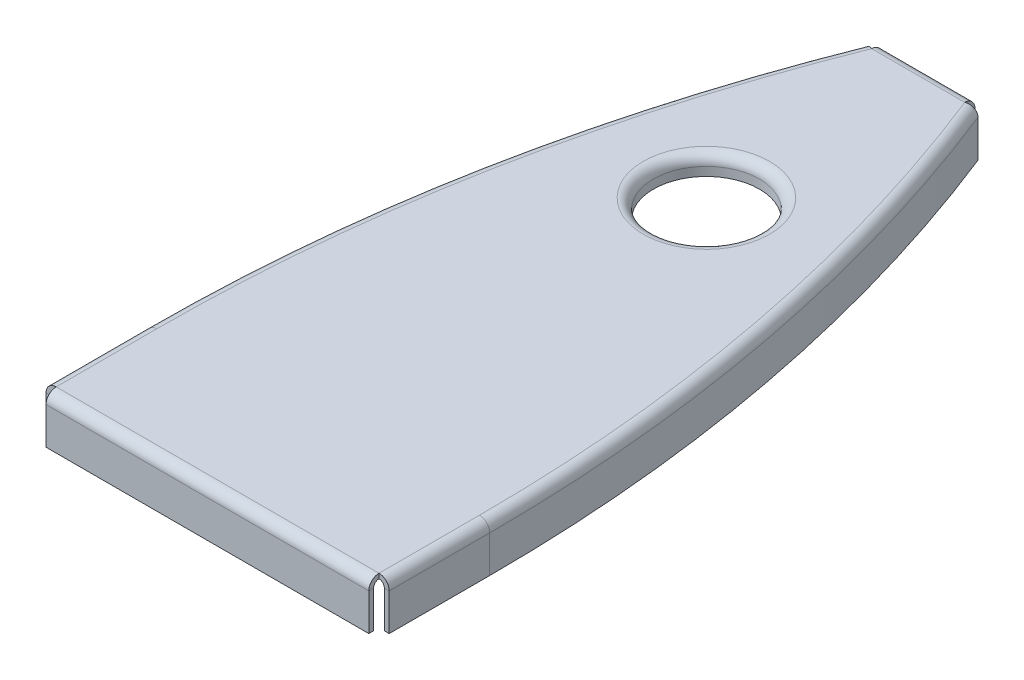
ISO-10303-21;
HEADER;
FILE_DESCRIPTION(('STEP AP214'),'2;1');
FILE_NAME('part.step','',(''),(''),'','','');
FILE_SCHEMA(('AUTOMOTIVE_DESIGN { 1 0 10303 214 1 1 1 1 }'));
ENDSEC;
DATA;
#1=APPLICATION_CONTEXT('core data for automotive mechanical design processes');
#2=APPLICATION_PROTOCOL_DEFINITION('international standard','automotive_design',2000,#1);
#3=PRODUCT_CONTEXT('',#1,'mechanical');
#4=PRODUCT('Part','Part','',(#3));
#5=PRODUCT_RELATED_PRODUCT_CATEGORY('part','',(#4));
#6=PRODUCT_DEFINITION_FORMATION('','',#4);
#7=PRODUCT_DEFINITION_CONTEXT('part definition',#1,'design');
#8=PRODUCT_DEFINITION('design','',#6,#7);
#9=PRODUCT_DEFINITION_SHAPE('','',#8);
#10=(LENGTH_UNIT() NAMED_UNIT(*) SI_UNIT(.MILLI.,.METRE.));
#11=(NAMED_UNIT(*) PLANE_ANGLE_UNIT() SI_UNIT($,.RADIAN.));
#12=(NAMED_UNIT(*) SI_UNIT($,.STERADIAN.) SOLID_ANGLE_UNIT());
#13=UNCERTAINTY_MEASURE_WITH_UNIT(LENGTH_MEASURE(1.E-05),#10,'distance_accuracy_value','');
#14=(GEOMETRIC_REPRESENTATION_CONTEXT(3) GLOBAL_UNCERTAINTY_ASSIGNED_CONTEXT((#13)) GLOBAL_UNIT_ASSIGNED_CONTEXT((#10,
#11,#12)) REPRESENTATION_CONTEXT('',''));
#15=CARTESIAN_POINT('',(0.,0.,0.));
#16=DIRECTION('',(0.,0.,1.));
#17=DIRECTION('',(1.,0.,0.));
#18=AXIS2_PLACEMENT_3D('',#15,#16,#17);
#19=CARTESIAN_POINT('',(114.3,0.,0.));
#20=DIRECTION('',(0.,-1.,0.));
#21=DIRECTION('',(0.,0.,-1.));
#22=AXIS2_PLACEMENT_3D('',#19,#20,#21);
#23=PLANE('',#22);
#24=CARTESIAN_POINT('',(0.,0.,-350.));
#25=DIRECTION('',(0.,-1.,0.));
#26=DIRECTION('',(0.,0.,-1.));
#27=AXIS2_PLACEMENT_3D('',#24,#25,#26);
#28=CIRCLE('',#27,44.7262999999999);
#29=CARTESIAN_POINT('',(0.,-8.15753714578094E-13,-394.7263));
#30=VERTEX_POINT('',#29);
#31=EDGE_CURVE('E13',#30,#30,#28,.T.);
#32=ORIENTED_EDGE('',*,*,#31,.F.);
#33=EDGE_LOOP('',(#32));
#34=FACE_BOUND('',#33,.T.);
#35=DIRECTION('',(0.,0.,1.));
#36=VECTOR('',#35,1.);
#37=CARTESIAN_POINT('',(-114.3,0.,0.));
#38=LINE('',#37,#36);
#39=CARTESIAN_POINT('',(-114.3,-8.15753714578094E-13,-75.));
#40=VERTEX_POINT('',#39);
#41=CARTESIAN_POINT('',(-114.3,0.,-3.80999999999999));
#42=VERTEX_POINT('',#41);
#43=EDGE_CURVE('E369',#40,#42,#38,.T.);
#44=ORIENTED_EDGE('',*,*,#43,.F.);
#45=CARTESIAN_POINT('',(1036.46329833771,-8.15753714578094E-13,-75.));
#46=DIRECTION('',(0.,1.,0.));
#47=DIRECTION('',(0.,0.,1.));
#48=AXIS2_PLACEMENT_3D('',#45,#46,#47);
#49=CIRCLE('',#48,1150.76329833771);
#50=CARTESIAN_POINT('',(-32.9436255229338,-8.15753714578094E-13,-500.));
#51=VERTEX_POINT('',#50);
#52=EDGE_CURVE('E551',#51,#40,#49,.T.);
#53=ORIENTED_EDGE('',*,*,#52,.F.);
#54=DIRECTION('',(-1.,0.,0.));
#55=VECTOR('',#54,1.);
#56=CARTESIAN_POINT('',(114.3,0.,-500.));
#57=LINE('',#56,#55);
#58=CARTESIAN_POINT('',(32.9436255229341,-8.03610650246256E-13,-500.));
#59=VERTEX_POINT('',#58);
#60=EDGE_CURVE('E385',#59,#51,#57,.T.);
#61=ORIENTED_EDGE('',*,*,#60,.F.);
#62=CARTESIAN_POINT('',(-1036.46329833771,-8.15753714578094E-13,-75.));
#63=DIRECTION('',(0.,1.,0.));
#64=DIRECTION('',(0.,0.,1.));
#65=AXIS2_PLACEMENT_3D('',#62,#63,#64);
#66=CIRCLE('',#65,1150.76329833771);
#67=CARTESIAN_POINT('',(114.3,-8.03610650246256E-13,-74.9999999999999));
#68=VERTEX_POINT('',#67);
#69=EDGE_CURVE('E417',#59,#68,#66,.F.);
#70=ORIENTED_EDGE('',*,*,#69,.T.);
#71=DIRECTION('',(0.,0.,1.));
#72=VECTOR('',#71,1.);
#73=CARTESIAN_POINT('',(114.3,0.,0.));
#74=LINE('',#73,#72);
#75=CARTESIAN_POINT('',(114.3,0.,-3.81));
#76=VERTEX_POINT('',#75);
#77=EDGE_CURVE('E348',#68,#76,#74,.T.);
#78=ORIENTED_EDGE('',*,*,#77,.T.);
#79=DIRECTION('',(-1.,0.,0.));
#80=VECTOR('',#79,1.);
#81=CARTESIAN_POINT('',(114.3,0.,-3.81));
#82=LINE('',#81,#80);
#83=EDGE_CURVE('E339',#76,#42,#82,.T.);
#84=ORIENTED_EDGE('',*,*,#83,.T.);
#85=EDGE_LOOP('',(#44,#53,#61,#70,#78,#84));
#86=FACE_BOUND('',#85,.T.);
#87=ADVANCED_FACE('F257',(#34,#86),#23,.T.);
#88=CARTESIAN_POINT('',(114.3,3.4163,0.));
#89=DIRECTION('',(0.,-1.,0.));
#90=DIRECTION('',(0.,0.,-1.));
#91=AXIS2_PLACEMENT_3D('',#88,#89,#90);
#92=PLANE('',#91);
#93=CARTESIAN_POINT('',(0.,3.41629999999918,-350.));
#94=DIRECTION('',(0.,-1.,0.));
#95=DIRECTION('',(0.,0.,-1.));
#96=AXIS2_PLACEMENT_3D('',#93,#94,#95);
#97=CIRCLE('',#96,44.7262999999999);
#98=CARTESIAN_POINT('',(0.,3.4163,-394.7263));
#99=VERTEX_POINT('',#98);
#100=EDGE_CURVE('E1433',#99,#99,#97,.T.);
#101=ORIENTED_EDGE('',*,*,#100,.T.);
#102=EDGE_LOOP('',(#101));
#103=FACE_BOUND('',#102,.T.);
#104=CARTESIAN_POINT('',(1036.46329833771,3.41629999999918,-75.));
#105=DIRECTION('',(0.,1.,0.));
#106=DIRECTION('',(0.,0.,1.));
#107=AXIS2_PLACEMENT_3D('',#104,#105,#106);
#108=CIRCLE('',#107,1150.76329833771);
#109=CARTESIAN_POINT('',(-32.9436255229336,3.41629999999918,-500.));
#110=VERTEX_POINT('',#109);
#111=CARTESIAN_POINT('',(-114.3,3.41629999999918,-75.0000000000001));
#112=VERTEX_POINT('',#111);
#113=EDGE_CURVE('E554',#110,#112,#108,.T.);
#114=ORIENTED_EDGE('',*,*,#113,.T.);
#115=DIRECTION('',(0.,0.,-1.));
#116=VECTOR('',#115,1.);
#117=CARTESIAN_POINT('',(-114.3,3.4163,0.));
#118=LINE('',#117,#116);
#119=CARTESIAN_POINT('',(-114.3,3.4163,-3.81));
#120=VERTEX_POINT('',#119);
#121=EDGE_CURVE('E372',#112,#120,#118,.F.);
#122=ORIENTED_EDGE('',*,*,#121,.T.);
#123=DIRECTION('',(-1.,0.,0.));
#124=VECTOR('',#123,1.);
#125=CARTESIAN_POINT('',(114.3,3.4163,-3.81));
#126=LINE('',#125,#124);
#127=CARTESIAN_POINT('',(114.3,3.41630000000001,-3.80999999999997));
#128=VERTEX_POINT('',#127);
#129=EDGE_CURVE('E379',#128,#120,#126,.T.);
#130=ORIENTED_EDGE('',*,*,#129,.F.);
#131=DIRECTION('',(0.,0.,-1.));
#132=VECTOR('',#131,1.);
#133=CARTESIAN_POINT('',(114.3,3.4163,0.));
#134=LINE('',#133,#132);
#135=CARTESIAN_POINT('',(114.3,3.4162999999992,-74.9999999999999));
#136=VERTEX_POINT('',#135);
#137=EDGE_CURVE('E351',#136,#128,#134,.F.);
#138=ORIENTED_EDGE('',*,*,#137,.F.);
#139=CARTESIAN_POINT('',(-1036.46329833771,3.41629999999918,-75.));
#140=DIRECTION('',(0.,1.,0.));
#141=DIRECTION('',(0.,0.,1.));
#142=AXIS2_PLACEMENT_3D('',#139,#140,#141);
#143=CIRCLE('',#142,1150.76329833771);
#144=CARTESIAN_POINT('',(32.9436255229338,3.4162999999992,-500.));
#145=VERTEX_POINT('',#144);
#146=EDGE_CURVE('E542',#145,#136,#143,.F.);
#147=ORIENTED_EDGE('',*,*,#146,.F.);
#148=DIRECTION('',(-1.,0.,0.));
#149=VECTOR('',#148,1.);
#150=CARTESIAN_POINT('',(114.3,3.4163,-500.));
#151=LINE('',#150,#149);
#152=EDGE_CURVE('E382',#145,#110,#151,.T.);
#153=ORIENTED_EDGE('',*,*,#152,.T.);
#154=EDGE_LOOP('',(#114,#122,#130,#138,#147,#153));
#155=FACE_BOUND('',#154,.T.);
#156=ADVANCED_FACE('F592',(#103,#155),#92,.F.);
#157=CARTESIAN_POINT('',(114.3,-3.81,0.));
#158=DIRECTION('',(1.,0.,0.));
#159=DIRECTION('',(0.,0.,-1.));
#160=AXIS2_PLACEMENT_3D('',#157,#158,#159);
#161=PLANE('',#160);
#162=DIRECTION('',(0.,0.,1.));
#163=VECTOR('',#162,1.);
#164=CARTESIAN_POINT('',(114.3,-3.81,0.));
#165=LINE('',#164,#163);
#166=CARTESIAN_POINT('',(114.3,-3.81,0.));
#167=VERTEX_POINT('',#166);
#168=CARTESIAN_POINT('',(114.3,-3.81,3.4163));
#169=VERTEX_POINT('',#168);
#170=EDGE_CURVE('E265',#167,#169,#165,.T.);
#171=ORIENTED_EDGE('',*,*,#170,.F.);
#172=CARTESIAN_POINT('',(114.3,-3.81,-3.81));
#173=DIRECTION('',(-1.,0.,0.));
#174=DIRECTION('',(0.,0.,1.));
#175=AXIS2_PLACEMENT_3D('',#172,#173,#174);
#176=CIRCLE('',#175,3.81);
#177=EDGE_CURVE('E322',#76,#167,#176,.F.);
#178=ORIENTED_EDGE('',*,*,#177,.F.);
#179=DIRECTION('',(0.,-1.,0.));
#180=VECTOR('',#179,1.);
#181=CARTESIAN_POINT('',(114.3,3.4163,-3.81));
#182=LINE('',#181,#180);
#183=EDGE_CURVE('E326',#128,#76,#182,.T.);
#184=ORIENTED_EDGE('',*,*,#183,.F.);
#185=CARTESIAN_POINT('',(114.3,-3.81,-3.81));
#186=DIRECTION('',(1.,0.,0.));
#187=DIRECTION('',(0.,0.,-1.));
#188=AXIS2_PLACEMENT_3D('',#185,#186,#187);
#189=CIRCLE('',#188,7.2263);
#190=EDGE_CURVE('E324',#128,#169,#189,.T.);
#191=ORIENTED_EDGE('',*,*,#190,.T.);
#192=EDGE_LOOP('',(#171,#178,#184,#191));
#193=FACE_BOUND('',#192,.T.);
#194=ADVANCED_FACE('F259',(#193),#161,.T.);
#195=CARTESIAN_POINT('',(114.3,3.4163,-3.81));
#196=DIRECTION('',(1.,0.,0.));
#197=DIRECTION('',(0.,0.,-1.));
#198=AXIS2_PLACEMENT_3D('',#195,#196,#197);
#199=PLANE('',#198);
#200=DIRECTION('',(0.,-1.,0.));
#201=VECTOR('',#200,1.);
#202=CARTESIAN_POINT('',(114.3,0.,0.));
#203=LINE('',#202,#201);
#204=CARTESIAN_POINT('',(114.3,-30.,0.));
#205=VERTEX_POINT('',#204);
#206=EDGE_CURVE('E333',#167,#205,#203,.T.);
#207=ORIENTED_EDGE('',*,*,#206,.F.);
#208=ORIENTED_EDGE('',*,*,#170,.T.);
#209=DIRECTION('',(0.,-1.,0.));
#210=VECTOR('',#209,1.);
#211=CARTESIAN_POINT('',(114.3,0.,3.4163));
#212=LINE('',#211,#210);
#213=CARTESIAN_POINT('',(114.3,-30.,3.4163));
#214=VERTEX_POINT('',#213);
#215=EDGE_CURVE('E310',#169,#214,#212,.T.);
#216=ORIENTED_EDGE('',*,*,#215,.T.);
#217=DIRECTION('',(0.,0.,1.));
#218=VECTOR('',#217,1.);
#219=CARTESIAN_POINT('',(114.3,-30.,0.));
#220=LINE('',#219,#218);
#221=EDGE_CURVE('E343',#205,#214,#220,.T.);
#222=ORIENTED_EDGE('',*,*,#221,.F.);
#223=EDGE_LOOP('',(#207,#208,#216,#222));
#224=FACE_BOUND('',#223,.T.);
#225=ADVANCED_FACE('F341',(#224),#199,.T.);
#226=CARTESIAN_POINT('',(-114.3,0.,-3.81));
#227=DIRECTION('',(-1.,0.,0.));
#228=DIRECTION('',(0.,0.,1.));
#229=AXIS2_PLACEMENT_3D('',#226,#227,#228);
#230=PLANE('',#229);
#231=DIRECTION('',(0.,1.,0.));
#232=VECTOR('',#231,1.);
#233=CARTESIAN_POINT('',(-114.3,0.,-3.81));
#234=LINE('',#233,#232);
#235=EDGE_CURVE('E393',#42,#120,#234,.T.);
#236=ORIENTED_EDGE('',*,*,#235,.F.);
#237=CARTESIAN_POINT('',(-114.3,-3.81,-3.81));
#238=DIRECTION('',(-1.,0.,0.));
#239=DIRECTION('',(0.,0.,1.));
#240=AXIS2_PLACEMENT_3D('',#237,#238,#239);
#241=CIRCLE('',#240,3.81);
#242=CARTESIAN_POINT('',(-114.3,-3.81,0.));
#243=VERTEX_POINT('',#242);
#244=EDGE_CURVE('E367',#42,#243,#241,.F.);
#245=ORIENTED_EDGE('',*,*,#244,.T.);
#246=DIRECTION('',(0.,0.,-1.));
#247=VECTOR('',#246,1.);
#248=CARTESIAN_POINT('',(-114.3,-3.81,3.4163));
#249=LINE('',#248,#247);
#250=CARTESIAN_POINT('',(-114.3,-3.81,3.4163));
#251=VERTEX_POINT('',#250);
#252=EDGE_CURVE('E304',#251,#243,#249,.T.);
#253=ORIENTED_EDGE('',*,*,#252,.F.);
#254=CARTESIAN_POINT('',(-114.3,-3.81,-3.81));
#255=DIRECTION('',(1.,0.,0.));
#256=DIRECTION('',(0.,0.,-1.));
#257=AXIS2_PLACEMENT_3D('',#254,#255,#256);
#258=CIRCLE('',#257,7.2263);
#259=EDGE_CURVE('E375',#120,#251,#258,.T.);
#260=ORIENTED_EDGE('',*,*,#259,.F.);
#261=EDGE_LOOP('',(#236,#245,#253,#260));
#262=FACE_BOUND('',#261,.T.);
#263=ADVANCED_FACE('F576',(#262),#230,.T.);
#264=CARTESIAN_POINT('',(114.3,0.,3.4163));
#265=DIRECTION('',(0.,0.,-1.));
#266=DIRECTION('',(0.,1.,0.));
#267=AXIS2_PLACEMENT_3D('',#264,#265,#266);
#268=PLANE('',#267);
#269=DIRECTION('',(0.,-1.,0.));
#270=VECTOR('',#269,1.);
#271=CARTESIAN_POINT('',(-114.3,0.,3.4163));
#272=LINE('',#271,#270);
#273=CARTESIAN_POINT('',(-114.3,-30.,3.4163));
#274=VERTEX_POINT('',#273);
#275=EDGE_CURVE('E359',#251,#274,#272,.T.);
#276=ORIENTED_EDGE('',*,*,#275,.T.);
#277=DIRECTION('',(-1.,0.,0.));
#278=VECTOR('',#277,1.);
#279=CARTESIAN_POINT('',(114.3,-30.,3.4163));
#280=LINE('',#279,#278);
#281=EDGE_CURVE('E390',#214,#274,#280,.T.);
#282=ORIENTED_EDGE('',*,*,#281,.F.);
#283=ORIENTED_EDGE('',*,*,#215,.F.);
#284=DIRECTION('',(-1.,0.,0.));
#285=VECTOR('',#284,1.);
#286=CARTESIAN_POINT('',(114.3,-3.81,3.4163));
#287=LINE('',#286,#285);
#288=EDGE_CURVE('E358',#169,#251,#287,.T.);
#289=ORIENTED_EDGE('',*,*,#288,.T.);
#290=EDGE_LOOP('',(#276,#282,#283,#289));
#291=FACE_BOUND('',#290,.T.);
#292=ADVANCED_FACE('F572',(#291),#268,.F.);
#293=CARTESIAN_POINT('',(114.3,-30.,0.));
#294=DIRECTION('',(0.,-1.,0.));
#295=DIRECTION('',(0.,0.,-1.));
#296=AXIS2_PLACEMENT_3D('',#293,#294,#295);
#297=PLANE('',#296);
#298=DIRECTION('',(0.,0.,1.));
#299=VECTOR('',#298,1.);
#300=CARTESIAN_POINT('',(-114.3,-30.,0.));
#301=LINE('',#300,#299);
#302=CARTESIAN_POINT('',(-114.3,-30.,0.));
#303=VERTEX_POINT('',#302);
#304=EDGE_CURVE('E362',#303,#274,#301,.T.);
#305=ORIENTED_EDGE('',*,*,#304,.F.);
#306=DIRECTION('',(-1.,0.,0.));
#307=VECTOR('',#306,1.);
#308=CARTESIAN_POINT('',(114.3,-30.,0.));
#309=LINE('',#308,#307);
#310=EDGE_CURVE('E338',#205,#303,#309,.T.);
#311=ORIENTED_EDGE('',*,*,#310,.F.);
#312=ORIENTED_EDGE('',*,*,#221,.T.);
#313=ORIENTED_EDGE('',*,*,#281,.T.);
#314=EDGE_LOOP('',(#305,#311,#312,#313));
#315=FACE_BOUND('',#314,.T.);
#316=ADVANCED_FACE('F567',(#315),#297,.T.);
#317=CARTESIAN_POINT('',(114.3,0.,0.));
#318=DIRECTION('',(0.,0.,-1.));
#319=DIRECTION('',(0.,1.,0.));
#320=AXIS2_PLACEMENT_3D('',#317,#318,#319);
#321=PLANE('',#320);
#322=DIRECTION('',(0.,-1.,0.));
#323=VECTOR('',#322,1.);
#324=CARTESIAN_POINT('',(-114.3,0.,0.));
#325=LINE('',#324,#323);
#326=EDGE_CURVE('E335',#243,#303,#325,.T.);
#327=ORIENTED_EDGE('',*,*,#326,.F.);
#328=DIRECTION('',(-1.,0.,0.));
#329=VECTOR('',#328,1.);
#330=CARTESIAN_POINT('',(114.3,-3.81,0.));
#331=LINE('',#330,#329);
#332=EDGE_CURVE('E331',#167,#243,#331,.T.);
#333=ORIENTED_EDGE('',*,*,#332,.F.);
#334=ORIENTED_EDGE('',*,*,#206,.T.);
#335=ORIENTED_EDGE('',*,*,#310,.T.);
#336=EDGE_LOOP('',(#327,#333,#334,#335));
#337=FACE_BOUND('',#336,.T.);
#338=ADVANCED_FACE('F332',(#337),#321,.T.);
#339=CARTESIAN_POINT('',(114.3,-3.81,-3.81));
#340=DIRECTION('',(-1.,0.,0.));
#341=DIRECTION('',(0.,0.,1.));
#342=AXIS2_PLACEMENT_3D('',#339,#340,#341);
#343=CYLINDRICAL_SURFACE('',#342,3.81);
#344=ORIENTED_EDGE('',*,*,#244,.F.);
#345=ORIENTED_EDGE('',*,*,#83,.F.);
#346=ORIENTED_EDGE('',*,*,#177,.T.);
#347=ORIENTED_EDGE('',*,*,#332,.T.);
#348=EDGE_LOOP('',(#344,#345,#346,#347));
#349=FACE_BOUND('',#348,.T.);
#350=ADVANCED_FACE('F346',(#349),#343,.F.);
#351=CARTESIAN_POINT('',(114.3,-3.81,-3.81));
#352=DIRECTION('',(-1.,0.,0.));
#353=DIRECTION('',(0.,0.,1.));
#354=AXIS2_PLACEMENT_3D('',#351,#352,#353);
#355=CYLINDRICAL_SURFACE('',#354,7.2263);
#356=ORIENTED_EDGE('',*,*,#259,.T.);
#357=ORIENTED_EDGE('',*,*,#288,.F.);
#358=ORIENTED_EDGE('',*,*,#190,.F.);
#359=ORIENTED_EDGE('',*,*,#129,.T.);
#360=EDGE_LOOP('',(#356,#357,#358,#359));
#361=FACE_BOUND('',#360,.T.);
#362=ADVANCED_FACE('F574',(#361),#355,.T.);
#363=CARTESIAN_POINT('',(-114.3,-3.81,-3.81));
#364=DIRECTION('',(-1.,0.,0.));
#365=DIRECTION('',(0.,0.,1.));
#366=AXIS2_PLACEMENT_3D('',#363,#364,#365);
#367=PLANE('',#366);
#368=ORIENTED_EDGE('',*,*,#275,.F.);
#369=ORIENTED_EDGE('',*,*,#252,.T.);
#370=ORIENTED_EDGE('',*,*,#326,.T.);
#371=ORIENTED_EDGE('',*,*,#304,.T.);
#372=EDGE_LOOP('',(#368,#369,#370,#371));
#373=FACE_BOUND('',#372,.T.);
#374=ADVANCED_FACE('F570',(#373),#367,.T.);
#375=CARTESIAN_POINT('',(-32.9436255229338,-3.81000000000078,-500.));
#376=DIRECTION('',(-1.,0.,0.));
#377=DIRECTION('',(0.,0.,1.));
#378=AXIS2_PLACEMENT_3D('',#375,#376,#377);
#379=PLANE('',#378);
#380=DIRECTION('',(0.,0.,-1.));
#381=VECTOR('',#380,1.);
#382=CARTESIAN_POINT('',(-32.9436255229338,-3.81000000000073,-507.2263));
#383=LINE('',#382,#381);
#384=CARTESIAN_POINT('',(-32.9436255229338,-3.81000000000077,-503.81));
#385=VERTEX_POINT('',#384);
#386=CARTESIAN_POINT('',(-32.9436255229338,-3.81000000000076,-507.2263));
#387=VERTEX_POINT('',#386);
#388=EDGE_CURVE('E500',#385,#387,#383,.T.);
#389=ORIENTED_EDGE('',*,*,#388,.F.);
#390=CARTESIAN_POINT('',(-32.9436255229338,-3.81000000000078,-500.));
#391=DIRECTION('',(1.,0.,0.));
#392=DIRECTION('',(0.,0.,-1.));
#393=AXIS2_PLACEMENT_3D('',#390,#391,#392);
#394=CIRCLE('',#393,3.80999999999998);
#395=EDGE_CURVE('E546',#51,#385,#394,.F.);
#396=ORIENTED_EDGE('',*,*,#395,.F.);
#397=DIRECTION('',(0.,1.,0.));
#398=VECTOR('',#397,1.);
#399=CARTESIAN_POINT('',(-32.9436255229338,-8.15753714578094E-13,-500.));
#400=LINE('',#399,#398);
#401=EDGE_CURVE('E363',#51,#110,#400,.T.);
#402=ORIENTED_EDGE('',*,*,#401,.T.);
#403=CARTESIAN_POINT('',(-32.9436255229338,-3.81000000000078,-500.));
#404=DIRECTION('',(1.,0.,0.));
#405=DIRECTION('',(0.,0.,-1.));
#406=AXIS2_PLACEMENT_3D('',#403,#404,#405);
#407=CIRCLE('',#406,7.22629999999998);
#408=EDGE_CURVE('E539',#110,#387,#407,.F.);
#409=ORIENTED_EDGE('',*,*,#408,.T.);
#410=EDGE_LOOP('',(#389,#396,#402,#409));
#411=FACE_BOUND('',#410,.T.);
#412=ADVANCED_FACE('F800',(#411),#379,.T.);
#413=CARTESIAN_POINT('',(32.9436255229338,-3.81000000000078,-500.));
#414=DIRECTION('',(-1.,0.,0.));
#415=DIRECTION('',(0.,0.,1.));
#416=AXIS2_PLACEMENT_3D('',#413,#414,#415);
#417=PLANE('',#416);
#418=CARTESIAN_POINT('',(32.9436255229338,-3.81000000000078,-500.));
#419=DIRECTION('',(1.,0.,0.));
#420=DIRECTION('',(0.,0.,-1.));
#421=AXIS2_PLACEMENT_3D('',#418,#419,#420);
#422=CIRCLE('',#421,3.80999999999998);
#423=CARTESIAN_POINT('',(32.9436255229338,-3.81000000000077,-503.81));
#424=VERTEX_POINT('',#423);
#425=EDGE_CURVE('E506',#424,#59,#422,.T.);
#426=ORIENTED_EDGE('',*,*,#425,.F.);
#427=DIRECTION('',(0.,0.,-1.));
#428=VECTOR('',#427,1.);
#429=CARTESIAN_POINT('',(32.9436255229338,-3.81000000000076,-503.81));
#430=LINE('',#429,#428);
#431=CARTESIAN_POINT('',(32.9436255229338,-3.81000000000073,-507.2263));
#432=VERTEX_POINT('',#431);
#433=EDGE_CURVE('E531',#424,#432,#430,.T.);
#434=ORIENTED_EDGE('',*,*,#433,.T.);
#435=CARTESIAN_POINT('',(32.9436255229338,-3.81000000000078,-500.));
#436=DIRECTION('',(1.,0.,0.));
#437=DIRECTION('',(0.,0.,-1.));
#438=AXIS2_PLACEMENT_3D('',#435,#436,#437);
#439=CIRCLE('',#438,7.22629999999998);
#440=EDGE_CURVE('E543',#432,#145,#439,.T.);
#441=ORIENTED_EDGE('',*,*,#440,.T.);
#442=DIRECTION('',(0.,1.,0.));
#443=VECTOR('',#442,1.);
#444=CARTESIAN_POINT('',(32.9436255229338,-8.15753714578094E-13,-500.));
#445=LINE('',#444,#443);
#446=EDGE_CURVE('E557',#59,#145,#445,.T.);
#447=ORIENTED_EDGE('',*,*,#446,.F.);
#448=EDGE_LOOP('',(#426,#434,#441,#447));
#449=FACE_BOUND('',#448,.T.);
#450=ADVANCED_FACE('F784',(#449),#417,.F.);
#451=CARTESIAN_POINT('',(32.9436255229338,-3.81000000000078,-500.));
#452=DIRECTION('',(1.,0.,0.));
#453=DIRECTION('',(0.,0.,-1.));
#454=AXIS2_PLACEMENT_3D('',#451,#452,#453);
#455=CYLINDRICAL_SURFACE('',#454,7.22629999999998);
#456=ORIENTED_EDGE('',*,*,#152,.F.);
#457=ORIENTED_EDGE('',*,*,#440,.F.);
#458=DIRECTION('',(1.,0.,0.));
#459=VECTOR('',#458,1.);
#460=CARTESIAN_POINT('',(0.,-3.81000000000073,-507.2263));
#461=LINE('',#460,#459);
#462=EDGE_CURVE('E528',#387,#432,#461,.T.);
#463=ORIENTED_EDGE('',*,*,#462,.F.);
#464=ORIENTED_EDGE('',*,*,#408,.F.);
#465=EDGE_LOOP('',(#456,#457,#463,#464));
#466=FACE_BOUND('',#465,.T.);
#467=ADVANCED_FACE('F799',(#466),#455,.T.);
#468=CARTESIAN_POINT('',(32.9436255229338,-3.81000000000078,-500.));
#469=DIRECTION('',(1.,0.,0.));
#470=DIRECTION('',(0.,0.,-1.));
#471=AXIS2_PLACEMENT_3D('',#468,#469,#470);
#472=CYLINDRICAL_SURFACE('',#471,3.80999999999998);
#473=ORIENTED_EDGE('',*,*,#60,.T.);
#474=ORIENTED_EDGE('',*,*,#395,.T.);
#475=DIRECTION('',(-1.,0.,0.));
#476=VECTOR('',#475,1.);
#477=CARTESIAN_POINT('',(-32.9436255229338,-3.81000000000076,-503.81));
#478=LINE('',#477,#476);
#479=EDGE_CURVE('E534',#385,#424,#478,.F.);
#480=ORIENTED_EDGE('',*,*,#479,.T.);
#481=ORIENTED_EDGE('',*,*,#425,.T.);
#482=EDGE_LOOP('',(#473,#474,#480,#481));
#483=FACE_BOUND('',#482,.T.);
#484=ADVANCED_FACE('F779',(#483),#472,.F.);
#485=CARTESIAN_POINT('',(32.9436255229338,-8.03825766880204E-13,-507.2263));
#486=DIRECTION('',(1.,0.,0.));
#487=DIRECTION('',(0.,0.,-1.));
#488=AXIS2_PLACEMENT_3D('',#485,#486,#487);
#489=PLANE('',#488);
#490=DIRECTION('',(0.,1.,0.));
#491=VECTOR('',#490,1.);
#492=CARTESIAN_POINT('',(32.9436255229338,-8.03825766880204E-13,-507.2263));
#493=LINE('',#492,#491);
#494=CARTESIAN_POINT('',(32.9436255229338,-29.9999999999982,-507.2263));
#495=VERTEX_POINT('',#494);
#496=EDGE_CURVE('E510',#495,#432,#493,.T.);
#497=ORIENTED_EDGE('',*,*,#496,.T.);
#498=ORIENTED_EDGE('',*,*,#433,.F.);
#499=DIRECTION('',(0.,-1.,0.));
#500=VECTOR('',#499,1.);
#501=CARTESIAN_POINT('',(32.9436255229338,1.85037170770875E-12,-503.81));
#502=LINE('',#501,#500);
#503=CARTESIAN_POINT('',(32.9436255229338,-29.9999999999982,-503.81));
#504=VERTEX_POINT('',#503);
#505=EDGE_CURVE('E519',#504,#424,#502,.F.);
#506=ORIENTED_EDGE('',*,*,#505,.F.);
#507=DIRECTION('',(0.,0.,1.));
#508=VECTOR('',#507,1.);
#509=CARTESIAN_POINT('',(32.9436255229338,-29.9999999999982,-507.2263));
#510=LINE('',#509,#508);
#511=EDGE_CURVE('E503',#495,#504,#510,.T.);
#512=ORIENTED_EDGE('',*,*,#511,.F.);
#513=EDGE_LOOP('',(#497,#498,#506,#512));
#514=FACE_BOUND('',#513,.T.);
#515=ADVANCED_FACE('F790',(#514),#489,.T.);
#516=CARTESIAN_POINT('',(-32.9436255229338,-29.9999999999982,-507.2263));
#517=DIRECTION('',(-1.,0.,0.));
#518=DIRECTION('',(0.,0.,1.));
#519=AXIS2_PLACEMENT_3D('',#516,#517,#518);
#520=PLANE('',#519);
#521=DIRECTION('',(0.,1.,0.));
#522=VECTOR('',#521,1.);
#523=CARTESIAN_POINT('',(-32.9436255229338,1.85037170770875E-12,-503.81));
#524=LINE('',#523,#522);
#525=CARTESIAN_POINT('',(-32.9436255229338,-29.9999999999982,-503.81));
#526=VERTEX_POINT('',#525);
#527=EDGE_CURVE('E525',#385,#526,#524,.F.);
#528=ORIENTED_EDGE('',*,*,#527,.F.);
#529=ORIENTED_EDGE('',*,*,#388,.T.);
#530=DIRECTION('',(0.,-1.,0.));
#531=VECTOR('',#530,1.);
#532=CARTESIAN_POINT('',(-32.9436255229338,-29.9999999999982,-507.2263));
#533=LINE('',#532,#531);
#534=CARTESIAN_POINT('',(-32.9436255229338,-29.9999999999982,-507.2263));
#535=VERTEX_POINT('',#534);
#536=EDGE_CURVE('E516',#387,#535,#533,.T.);
#537=ORIENTED_EDGE('',*,*,#536,.T.);
#538=DIRECTION('',(0.,0.,1.));
#539=VECTOR('',#538,1.);
#540=CARTESIAN_POINT('',(-32.9436255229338,-29.9999999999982,-507.2263));
#541=LINE('',#540,#539);
#542=EDGE_CURVE('E507',#535,#526,#541,.T.);
#543=ORIENTED_EDGE('',*,*,#542,.T.);
#544=EDGE_LOOP('',(#528,#529,#537,#543));
#545=FACE_BOUND('',#544,.T.);
#546=ADVANCED_FACE('F802',(#545),#520,.T.);
#547=CARTESIAN_POINT('',(0.,1.86229965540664E-12,-507.2263));
#548=DIRECTION('',(0.,0.,-1.));
#549=DIRECTION('',(0.,1.,0.));
#550=AXIS2_PLACEMENT_3D('',#547,#548,#549);
#551=PLANE('',#550);
#552=ORIENTED_EDGE('',*,*,#536,.F.);
#553=ORIENTED_EDGE('',*,*,#462,.T.);
#554=ORIENTED_EDGE('',*,*,#496,.F.);
#555=DIRECTION('',(1.,0.,0.));
#556=VECTOR('',#555,1.);
#557=CARTESIAN_POINT('',(32.9436255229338,-29.9999999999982,-507.2263));
#558=LINE('',#557,#556);
#559=EDGE_CURVE('E513',#535,#495,#558,.T.);
#560=ORIENTED_EDGE('',*,*,#559,.F.);
#561=EDGE_LOOP('',(#552,#553,#554,#560));
#562=FACE_BOUND('',#561,.T.);
#563=ADVANCED_FACE('F795',(#562),#551,.T.);
#564=CARTESIAN_POINT('',(0.,1.85037170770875E-12,-503.81));
#565=DIRECTION('',(0.,0.,-1.));
#566=DIRECTION('',(0.,1.,0.));
#567=AXIS2_PLACEMENT_3D('',#564,#565,#566);
#568=PLANE('',#567);
#569=ORIENTED_EDGE('',*,*,#479,.F.);
#570=ORIENTED_EDGE('',*,*,#527,.T.);
#571=DIRECTION('',(-1.,0.,0.));
#572=VECTOR('',#571,1.);
#573=CARTESIAN_POINT('',(0.,-29.9999999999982,-503.81));
#574=LINE('',#573,#572);
#575=EDGE_CURVE('E522',#526,#504,#574,.F.);
#576=ORIENTED_EDGE('',*,*,#575,.T.);
#577=ORIENTED_EDGE('',*,*,#505,.T.);
#578=EDGE_LOOP('',(#569,#570,#576,#577));
#579=FACE_BOUND('',#578,.T.);
#580=ADVANCED_FACE('F787',(#579),#568,.F.);
#581=CARTESIAN_POINT('',(32.9436255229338,-29.9999999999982,-507.2263));
#582=DIRECTION('',(0.,-1.,0.));
#583=DIRECTION('',(0.,0.,-1.));
#584=AXIS2_PLACEMENT_3D('',#581,#582,#583);
#585=PLANE('',#584);
#586=ORIENTED_EDGE('',*,*,#575,.F.);
#587=ORIENTED_EDGE('',*,*,#542,.F.);
#588=ORIENTED_EDGE('',*,*,#559,.T.);
#589=ORIENTED_EDGE('',*,*,#511,.T.);
#590=EDGE_LOOP('',(#586,#587,#588,#589));
#591=FACE_BOUND('',#590,.T.);
#592=ADVANCED_FACE('F805',(#591),#585,.T.);
#593=CARTESIAN_POINT('',(114.3,-3.80999999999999,-3.80999999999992));
#594=DIRECTION('',(0.,0.,-1.));
#595=DIRECTION('',(0.,1.,0.));
#596=AXIS2_PLACEMENT_3D('',#593,#594,#595);
#597=PLANE('',#596);
#598=DIRECTION('',(-1.,0.,0.));
#599=VECTOR('',#598,1.);
#600=CARTESIAN_POINT('',(118.11,-3.81,-3.80999999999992));
#601=LINE('',#600,#599);
#602=CARTESIAN_POINT('',(121.5263,-3.81000000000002,-3.80999999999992));
#603=VERTEX_POINT('',#602);
#604=CARTESIAN_POINT('',(118.11,-3.81,-3.80999999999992));
#605=VERTEX_POINT('',#604);
#606=EDGE_CURVE('E497',#603,#605,#601,.T.);
#607=ORIENTED_EDGE('',*,*,#606,.F.);
#608=CARTESIAN_POINT('',(114.3,-3.80999999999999,-3.80999999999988));
#609=DIRECTION('',(0.,0.,1.));
#610=DIRECTION('',(0.,-1.,0.));
#611=AXIS2_PLACEMENT_3D('',#608,#609,#610);
#612=CIRCLE('',#611,7.2263);
#613=EDGE_CURVE('E407',#128,#603,#612,.F.);
#614=ORIENTED_EDGE('',*,*,#613,.F.);
#615=ORIENTED_EDGE('',*,*,#183,.T.);
#616=CARTESIAN_POINT('',(114.3,-3.80999999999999,-3.80999999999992));
#617=DIRECTION('',(0.,0.,1.));
#618=DIRECTION('',(1.,0.,0.));
#619=AXIS2_PLACEMENT_3D('',#616,#617,#618);
#620=CIRCLE('',#619,3.81);
#621=EDGE_CURVE('E403',#76,#605,#620,.F.);
#622=ORIENTED_EDGE('',*,*,#621,.T.);
#623=EDGE_LOOP('',(#607,#614,#615,#622));
#624=FACE_BOUND('',#623,.T.);
#625=ADVANCED_FACE('F401',(#624),#597,.F.);
#626=CARTESIAN_POINT('',(32.9436255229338,-3.8100000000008,-500.));
#627=DIRECTION('',(-0.36932008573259,0.,-0.929302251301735));
#628=DIRECTION('',(-0.929302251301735,0.,0.36932008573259));
#629=AXIS2_PLACEMENT_3D('',#626,#627,#628);
#630=PLANE('',#629);
#631=ORIENTED_EDGE('',*,*,#446,.T.);
#632=CARTESIAN_POINT('',(32.9436255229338,-3.8100000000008,-500.));
#633=DIRECTION('',(-0.36932008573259,0.,-0.929302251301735));
#634=DIRECTION('',(-0.929302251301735,0.,0.36932008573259));
#635=AXIS2_PLACEMENT_3D('',#632,#633,#634);
#636=CIRCLE('',#635,7.2263);
#637=CARTESIAN_POINT('',(39.6590423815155,-3.81000000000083,-502.668817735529));
#638=VERTEX_POINT('',#637);
#639=EDGE_CURVE('E481',#145,#638,#636,.T.);
#640=ORIENTED_EDGE('',*,*,#639,.T.);
#641=DIRECTION('',(-0.929302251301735,0.,0.36932008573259));
#642=VECTOR('',#641,1.);
#643=CARTESIAN_POINT('',(36.4842671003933,-3.81000000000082,-501.407109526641));
#644=LINE('',#643,#642);
#645=CARTESIAN_POINT('',(36.4842671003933,-3.81000000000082,-501.407109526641));
#646=VERTEX_POINT('',#645);
#647=EDGE_CURVE('E494',#638,#646,#644,.T.);
#648=ORIENTED_EDGE('',*,*,#647,.T.);
#649=CARTESIAN_POINT('',(32.9436255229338,-3.8100000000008,-500.));
#650=DIRECTION('',(0.36932008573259,0.,0.929302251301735));
#651=DIRECTION('',(0.929302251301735,0.,-0.36932008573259));
#652=AXIS2_PLACEMENT_3D('',#649,#650,#651);
#653=CIRCLE('',#652,3.81);
#654=EDGE_CURVE('E439',#59,#646,#653,.F.);
#655=ORIENTED_EDGE('',*,*,#654,.F.);
#656=EDGE_LOOP('',(#631,#640,#648,#655));
#657=FACE_BOUND('',#656,.T.);
#658=ADVANCED_FACE('F812',(#657),#630,.T.);
#659=CARTESIAN_POINT('',(36.4842671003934,-16.9050000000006,-501.407109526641));
#660=DIRECTION('',(0.36932008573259,0.,0.929302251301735));
#661=DIRECTION('',(0.,-1.,0.));
#662=AXIS2_PLACEMENT_3D('',#659,#660,#661);
#663=PLANE('',#662);
#664=ORIENTED_EDGE('',*,*,#647,.F.);
#665=DIRECTION('',(0.,-1.,0.));
#666=VECTOR('',#665,1.);
#667=CARTESIAN_POINT('',(39.6590423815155,-8.15753714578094E-13,-502.668817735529));
#668=LINE('',#667,#666);
#669=CARTESIAN_POINT('',(39.6590423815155,-30.0000000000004,-502.668817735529));
#670=VERTEX_POINT('',#669);
#671=EDGE_CURVE('E471',#638,#670,#668,.T.);
#672=ORIENTED_EDGE('',*,*,#671,.T.);
#673=DIRECTION('',(-0.929302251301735,0.,0.36932008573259));
#674=VECTOR('',#673,1.);
#675=CARTESIAN_POINT('',(36.4842671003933,-30.0000000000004,-501.407109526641));
#676=LINE('',#675,#674);
#677=CARTESIAN_POINT('',(36.4842671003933,-30.0000000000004,-501.407109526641));
#678=VERTEX_POINT('',#677);
#679=EDGE_CURVE('E491',#670,#678,#676,.T.);
#680=ORIENTED_EDGE('',*,*,#679,.T.);
#681=DIRECTION('',(0.,-1.,0.));
#682=VECTOR('',#681,1.);
#683=CARTESIAN_POINT('',(36.4842671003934,-8.03610650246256E-13,-501.407109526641));
#684=LINE('',#683,#682);
#685=EDGE_CURVE('E434',#646,#678,#684,.T.);
#686=ORIENTED_EDGE('',*,*,#685,.F.);
#687=EDGE_LOOP('',(#664,#672,#680,#686));
#688=FACE_BOUND('',#687,.T.);
#689=ADVANCED_FACE('F1142',(#688),#663,.F.);
#690=CARTESIAN_POINT('',(-1036.46329833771,-30.0000000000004,-75.));
#691=DIRECTION('',(0.,1.,0.));
#692=DIRECTION('',(0.,0.,1.));
#693=AXIS2_PLACEMENT_3D('',#690,#691,#692);
#694=PLANE('',#693);
#695=ORIENTED_EDGE('',*,*,#679,.F.);
#696=CARTESIAN_POINT('',(-1036.46329833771,-30.0000000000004,-75.));
#697=DIRECTION('',(0.,-1.,0.));
#698=DIRECTION('',(0.,0.,-1.));
#699=AXIS2_PLACEMENT_3D('',#696,#697,#698);
#700=CIRCLE('',#699,1157.98959833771);
#701=CARTESIAN_POINT('',(121.5263,-30.0000000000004,-75.));
#702=VERTEX_POINT('',#701);
#703=EDGE_CURVE('E466',#670,#702,#700,.T.);
#704=ORIENTED_EDGE('',*,*,#703,.T.);
#705=DIRECTION('',(-1.,0.,0.));
#706=VECTOR('',#705,1.);
#707=CARTESIAN_POINT('',(118.11,-30.0000000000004,-75.));
#708=LINE('',#707,#706);
#709=CARTESIAN_POINT('',(118.11,-30.0000000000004,-75.));
#710=VERTEX_POINT('',#709);
#711=EDGE_CURVE('E488',#702,#710,#708,.T.);
#712=ORIENTED_EDGE('',*,*,#711,.T.);
#713=CARTESIAN_POINT('',(-1036.46329833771,-30.0000000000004,-75.));
#714=DIRECTION('',(0.,-1.,0.));
#715=DIRECTION('',(0.929302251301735,0.,-0.36932008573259));
#716=AXIS2_PLACEMENT_3D('',#713,#714,#715);
#717=CIRCLE('',#716,1154.57329833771);
#718=EDGE_CURVE('E446',#678,#710,#717,.T.);
#719=ORIENTED_EDGE('',*,*,#718,.F.);
#720=EDGE_LOOP('',(#695,#704,#712,#719));
#721=FACE_BOUND('',#720,.T.);
#722=ADVANCED_FACE('F1132',(#721),#694,.F.);
#723=CARTESIAN_POINT('',(118.11,-30.0000000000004,-74.9999999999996));
#724=DIRECTION('',(0.,-1.,0.));
#725=DIRECTION('',(0.,0.,1.));
#726=AXIS2_PLACEMENT_3D('',#723,#724,#725);
#727=PLANE('',#726);
#728=ORIENTED_EDGE('',*,*,#711,.F.);
#729=DIRECTION('',(0.,0.,1.));
#730=VECTOR('',#729,1.);
#731=CARTESIAN_POINT('',(121.5263,-30.0000000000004,-75.));
#732=LINE('',#731,#730);
#733=CARTESIAN_POINT('',(121.5263,-29.9999999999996,-3.80999999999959));
#734=VERTEX_POINT('',#733);
#735=EDGE_CURVE('E474',#702,#734,#732,.T.);
#736=ORIENTED_EDGE('',*,*,#735,.T.);
#737=DIRECTION('',(-1.,0.,0.));
#738=VECTOR('',#737,1.);
#739=CARTESIAN_POINT('',(118.11,-29.9999999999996,-3.80999999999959));
#740=LINE('',#739,#738);
#741=CARTESIAN_POINT('',(118.11,-29.9999999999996,-3.80999999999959));
#742=VERTEX_POINT('',#741);
#743=EDGE_CURVE('E458',#734,#742,#740,.T.);
#744=ORIENTED_EDGE('',*,*,#743,.T.);
#745=DIRECTION('',(0.,0.,1.));
#746=VECTOR('',#745,1.);
#747=CARTESIAN_POINT('',(118.11,-30.0000000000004,-74.9999999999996));
#748=LINE('',#747,#746);
#749=EDGE_CURVE('E455',#710,#742,#748,.T.);
#750=ORIENTED_EDGE('',*,*,#749,.F.);
#751=EDGE_LOOP('',(#728,#736,#744,#750));
#752=FACE_BOUND('',#751,.T.);
#753=ADVANCED_FACE('F1122',(#752),#727,.T.);
#754=CARTESIAN_POINT('',(118.11,0.,-3.80999999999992));
#755=DIRECTION('',(0.,0.,-1.));
#756=DIRECTION('',(0.,-1.,0.));
#757=AXIS2_PLACEMENT_3D('',#754,#755,#756);
#758=PLANE('',#757);
#759=DIRECTION('',(0.,-1.,0.));
#760=VECTOR('',#759,1.);
#761=CARTESIAN_POINT('',(121.5263,-8.17091680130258E-13,-3.80999999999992));
#762=LINE('',#761,#760);
#763=EDGE_CURVE('E462',#603,#734,#762,.T.);
#764=ORIENTED_EDGE('',*,*,#763,.F.);
#765=ORIENTED_EDGE('',*,*,#606,.T.);
#766=DIRECTION('',(0.,-1.,0.));
#767=VECTOR('',#766,1.);
#768=CARTESIAN_POINT('',(118.11,0.,-3.80999999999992));
#769=LINE('',#768,#767);
#770=EDGE_CURVE('E447',#605,#742,#769,.T.);
#771=ORIENTED_EDGE('',*,*,#770,.T.);
#772=ORIENTED_EDGE('',*,*,#743,.F.);
#773=EDGE_LOOP('',(#764,#765,#771,#772));
#774=FACE_BOUND('',#773,.T.);
#775=ADVANCED_FACE('F1112',(#774),#758,.F.);
#776=CARTESIAN_POINT('',(118.11,-8.03610650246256E-13,-75.));
#777=DIRECTION('',(-1.,0.,0.));
#778=DIRECTION('',(0.,-1.,0.));
#779=AXIS2_PLACEMENT_3D('',#776,#777,#778);
#780=PLANE('',#779);
#781=ORIENTED_EDGE('',*,*,#749,.T.);
#782=ORIENTED_EDGE('',*,*,#770,.F.);
#783=DIRECTION('',(0.,0.,1.));
#784=VECTOR('',#783,1.);
#785=CARTESIAN_POINT('',(118.11,-3.81000000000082,-75.));
#786=LINE('',#785,#784);
#787=CARTESIAN_POINT('',(118.11,-3.81000000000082,-74.9999999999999));
#788=VERTEX_POINT('',#787);
#789=EDGE_CURVE('E445',#788,#605,#786,.T.);
#790=ORIENTED_EDGE('',*,*,#789,.F.);
#791=DIRECTION('',(0.,-1.,0.));
#792=VECTOR('',#791,1.);
#793=CARTESIAN_POINT('',(118.11,-8.03610650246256E-13,-75.));
#794=LINE('',#793,#792);
#795=EDGE_CURVE('E436',#788,#710,#794,.T.);
#796=ORIENTED_EDGE('',*,*,#795,.T.);
#797=EDGE_LOOP('',(#781,#782,#790,#796));
#798=FACE_BOUND('',#797,.T.);
#799=ADVANCED_FACE('F1103',(#798),#780,.T.);
#800=CARTESIAN_POINT('',(114.3,-3.8100000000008,-75.));
#801=DIRECTION('',(0.,0.,1.));
#802=DIRECTION('',(0.,-1.,0.));
#803=AXIS2_PLACEMENT_3D('',#800,#801,#802);
#804=CYLINDRICAL_SURFACE('',#803,3.81);
#805=ORIENTED_EDGE('',*,*,#789,.T.);
#806=ORIENTED_EDGE('',*,*,#621,.F.);
#807=ORIENTED_EDGE('',*,*,#77,.F.);
#808=CARTESIAN_POINT('',(114.3,-3.8100000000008,-75.));
#809=DIRECTION('',(0.,0.,1.));
#810=DIRECTION('',(1.,0.,0.));
#811=AXIS2_PLACEMENT_3D('',#808,#809,#810);
#812=CIRCLE('',#811,3.81);
#813=EDGE_CURVE('E423',#68,#788,#812,.F.);
#814=ORIENTED_EDGE('',*,*,#813,.T.);
#815=EDGE_LOOP('',(#805,#806,#807,#814));
#816=FACE_BOUND('',#815,.T.);
#817=ADVANCED_FACE('F421',(#816),#804,.F.);
#818=CARTESIAN_POINT('',(-1036.46329833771,-8.15753714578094E-13,-75.));
#819=DIRECTION('',(0.,-1.,0.));
#820=DIRECTION('',(0.,0.,-1.));
#821=AXIS2_PLACEMENT_3D('',#818,#819,#820);
#822=CYLINDRICAL_SURFACE('',#821,1154.57329833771);
#823=ORIENTED_EDGE('',*,*,#718,.T.);
#824=ORIENTED_EDGE('',*,*,#795,.F.);
#825=CARTESIAN_POINT('',(-1036.46329833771,-3.81000000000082,-75.));
#826=DIRECTION('',(0.,-1.,0.));
#827=DIRECTION('',(0.929302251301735,0.,-0.36932008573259));
#828=AXIS2_PLACEMENT_3D('',#825,#826,#827);
#829=CIRCLE('',#828,1154.57329833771);
#830=EDGE_CURVE('E433',#646,#788,#829,.T.);
#831=ORIENTED_EDGE('',*,*,#830,.F.);
#832=ORIENTED_EDGE('',*,*,#685,.T.);
#833=EDGE_LOOP('',(#823,#824,#831,#832));
#834=FACE_BOUND('',#833,.T.);
#835=ADVANCED_FACE('F1085',(#834),#822,.F.);
#836=CARTESIAN_POINT('',(-1036.46329833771,-3.8100000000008,-75.));
#837=DIRECTION('',(0.,-1.,0.));
#838=DIRECTION('',(0.,0.,-1.));
#839=AXIS2_PLACEMENT_3D('',#836,#837,#838);
#840=TOROIDAL_SURFACE('',#839,1150.76329833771,3.81);
#841=ORIENTED_EDGE('',*,*,#830,.T.);
#842=ORIENTED_EDGE('',*,*,#813,.F.);
#843=ORIENTED_EDGE('',*,*,#69,.F.);
#844=ORIENTED_EDGE('',*,*,#654,.T.);
#845=EDGE_LOOP('',(#841,#842,#843,#844));
#846=FACE_BOUND('',#845,.T.);
#847=ADVANCED_FACE('F428',(#846),#840,.F.);
#848=CARTESIAN_POINT('',(121.5263,-8.17091680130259E-13,-75.));
#849=DIRECTION('',(-1.,0.,0.));
#850=DIRECTION('',(0.,-1.,0.));
#851=AXIS2_PLACEMENT_3D('',#848,#849,#850);
#852=PLANE('',#851);
#853=ORIENTED_EDGE('',*,*,#735,.F.);
#854=DIRECTION('',(0.,-1.,0.));
#855=VECTOR('',#854,1.);
#856=CARTESIAN_POINT('',(121.5263,-8.17091680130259E-13,-74.9999999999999));
#857=LINE('',#856,#855);
#858=CARTESIAN_POINT('',(121.5263,-3.81000000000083,-74.9999999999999));
#859=VERTEX_POINT('',#858);
#860=EDGE_CURVE('E463',#859,#702,#857,.T.);
#861=ORIENTED_EDGE('',*,*,#860,.F.);
#862=DIRECTION('',(0.,0.,1.));
#863=VECTOR('',#862,1.);
#864=CARTESIAN_POINT('',(121.5263,-3.81000000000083,-74.9999999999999));
#865=LINE('',#864,#863);
#866=EDGE_CURVE('E459',#859,#603,#865,.T.);
#867=ORIENTED_EDGE('',*,*,#866,.T.);
#868=ORIENTED_EDGE('',*,*,#763,.T.);
#869=EDGE_LOOP('',(#853,#861,#867,#868));
#870=FACE_BOUND('',#869,.T.);
#871=ADVANCED_FACE('F1066',(#870),#852,.F.);
#872=CARTESIAN_POINT('',(114.3,-3.8100000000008,-75.));
#873=DIRECTION('',(0.,0.,1.));
#874=DIRECTION('',(0.,-1.,0.));
#875=AXIS2_PLACEMENT_3D('',#872,#873,#874);
#876=CYLINDRICAL_SURFACE('',#875,7.2263);
#877=ORIENTED_EDGE('',*,*,#866,.F.);
#878=CARTESIAN_POINT('',(114.3,-3.8100000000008,-74.9999999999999));
#879=DIRECTION('',(0.,0.,1.));
#880=DIRECTION('',(0.,-1.,0.));
#881=AXIS2_PLACEMENT_3D('',#878,#879,#880);
#882=CIRCLE('',#881,7.2263);
#883=EDGE_CURVE('E468',#136,#859,#882,.F.);
#884=ORIENTED_EDGE('',*,*,#883,.F.);
#885=ORIENTED_EDGE('',*,*,#137,.T.);
#886=ORIENTED_EDGE('',*,*,#613,.T.);
#887=EDGE_LOOP('',(#877,#884,#885,#886));
#888=FACE_BOUND('',#887,.T.);
#889=ADVANCED_FACE('F1056',(#888),#876,.T.);
#890=CARTESIAN_POINT('',(-1036.46329833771,-8.15753714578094E-13,-75.));
#891=DIRECTION('',(0.,-1.,0.));
#892=DIRECTION('',(0.,0.,-1.));
#893=AXIS2_PLACEMENT_3D('',#890,#891,#892);
#894=CYLINDRICAL_SURFACE('',#893,1157.98959833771);
#895=ORIENTED_EDGE('',*,*,#703,.F.);
#896=ORIENTED_EDGE('',*,*,#671,.F.);
#897=CARTESIAN_POINT('',(-1036.46329833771,-3.81000000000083,-75.));
#898=DIRECTION('',(0.,-1.,0.));
#899=DIRECTION('',(0.,0.,-1.));
#900=AXIS2_PLACEMENT_3D('',#897,#898,#899);
#901=CIRCLE('',#900,1157.98959833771);
#902=EDGE_CURVE('E467',#638,#859,#901,.T.);
#903=ORIENTED_EDGE('',*,*,#902,.T.);
#904=ORIENTED_EDGE('',*,*,#860,.T.);
#905=EDGE_LOOP('',(#895,#896,#903,#904));
#906=FACE_BOUND('',#905,.T.);
#907=ADVANCED_FACE('F1046',(#906),#894,.T.);
#908=CARTESIAN_POINT('',(-1036.46329833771,-3.8100000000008,-75.));
#909=DIRECTION('',(0.,-1.,0.));
#910=DIRECTION('',(0.,0.,-1.));
#911=AXIS2_PLACEMENT_3D('',#908,#909,#910);
#912=TOROIDAL_SURFACE('',#911,1150.76329833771,7.2263);
#913=ORIENTED_EDGE('',*,*,#902,.F.);
#914=ORIENTED_EDGE('',*,*,#639,.F.);
#915=ORIENTED_EDGE('',*,*,#146,.T.);
#916=ORIENTED_EDGE('',*,*,#883,.T.);
#917=EDGE_LOOP('',(#913,#914,#915,#916));
#918=FACE_BOUND('',#917,.T.);
#919=ADVANCED_FACE('F1037',(#918),#912,.T.);
#920=CARTESIAN_POINT('',(-114.3,-3.81,-3.81));
#921=DIRECTION('',(0.,0.,1.));
#922=DIRECTION('',(0.,-1.,0.));
#923=AXIS2_PLACEMENT_3D('',#920,#921,#922);
#924=PLANE('',#923);
#925=DIRECTION('',(-1.,0.,0.));
#926=VECTOR('',#925,1.);
#927=CARTESIAN_POINT('',(-118.11,-3.81000000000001,-3.80999999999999));
#928=LINE('',#927,#926);
#929=CARTESIAN_POINT('',(-118.11,-3.81000000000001,-3.80999999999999));
#930=VERTEX_POINT('',#929);
#931=CARTESIAN_POINT('',(-121.5263,-3.81000000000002,-3.80999999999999));
#932=VERTEX_POINT('',#931);
#933=EDGE_CURVE('E484',#930,#932,#928,.T.);
#934=ORIENTED_EDGE('',*,*,#933,.F.);
#935=CARTESIAN_POINT('',(-114.3,-3.81,-3.81));
#936=DIRECTION('',(0.,0.,-1.));
#937=DIRECTION('',(0.,1.,0.));
#938=AXIS2_PLACEMENT_3D('',#935,#936,#937);
#939=CIRCLE('',#938,3.81);
#940=EDGE_CURVE('E589',#42,#930,#939,.F.);
#941=ORIENTED_EDGE('',*,*,#940,.F.);
#942=ORIENTED_EDGE('',*,*,#235,.T.);
#943=CARTESIAN_POINT('',(-114.3,-3.81,-3.80999999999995));
#944=DIRECTION('',(0.,0.,1.));
#945=DIRECTION('',(0.,-1.,0.));
#946=AXIS2_PLACEMENT_3D('',#943,#944,#945);
#947=CIRCLE('',#946,7.2263);
#948=EDGE_CURVE('E586',#120,#932,#947,.T.);
#949=ORIENTED_EDGE('',*,*,#948,.T.);
#950=EDGE_LOOP('',(#934,#941,#942,#949));
#951=FACE_BOUND('',#950,.T.);
#952=ADVANCED_FACE('F584',(#951),#924,.T.);
#953=CARTESIAN_POINT('',(-32.9436255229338,-3.81000000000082,-500.));
#954=DIRECTION('',(-0.369320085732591,0.,0.929302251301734));
#955=DIRECTION('',(0.929302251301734,0.,0.369320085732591));
#956=AXIS2_PLACEMENT_3D('',#953,#954,#955);
#957=PLANE('',#956);
#958=ORIENTED_EDGE('',*,*,#401,.F.);
#959=CARTESIAN_POINT('',(-32.9436255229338,-3.81000000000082,-500.));
#960=DIRECTION('',(0.369320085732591,0.,-0.929302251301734));
#961=DIRECTION('',(0.,1.,0.));
#962=AXIS2_PLACEMENT_3D('',#959,#960,#961);
#963=CIRCLE('',#962,3.81);
#964=CARTESIAN_POINT('',(-36.4842671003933,-3.81000000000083,-501.407109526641));
#965=VERTEX_POINT('',#964);
#966=EDGE_CURVE('E636',#51,#965,#963,.F.);
#967=ORIENTED_EDGE('',*,*,#966,.T.);
#968=DIRECTION('',(-0.929302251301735,0.,-0.36932008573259));
#969=VECTOR('',#968,1.);
#970=CARTESIAN_POINT('',(-36.4842671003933,-3.81000000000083,-501.407109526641));
#971=LINE('',#970,#969);
#972=CARTESIAN_POINT('',(-39.6590423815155,-3.81000000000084,-502.668817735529));
#973=VERTEX_POINT('',#972);
#974=EDGE_CURVE('E670',#965,#973,#971,.T.);
#975=ORIENTED_EDGE('',*,*,#974,.T.);
#976=CARTESIAN_POINT('',(-32.9436255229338,-3.81000000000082,-500.));
#977=DIRECTION('',(0.36932008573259,0.,-0.929302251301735));
#978=DIRECTION('',(-0.929302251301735,0.,-0.36932008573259));
#979=AXIS2_PLACEMENT_3D('',#976,#977,#978);
#980=CIRCLE('',#979,7.2263);
#981=EDGE_CURVE('E617',#110,#973,#980,.F.);
#982=ORIENTED_EDGE('',*,*,#981,.F.);
#983=EDGE_LOOP('',(#958,#967,#975,#982));
#984=FACE_BOUND('',#983,.T.);
#985=ADVANCED_FACE('F1018',(#984),#957,.F.);
#986=CARTESIAN_POINT('',(-36.4842671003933,-16.9050000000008,-501.407109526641));
#987=DIRECTION('',(0.36932008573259,0.,-0.929302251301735));
#988=DIRECTION('',(0.,-1.,0.));
#989=AXIS2_PLACEMENT_3D('',#986,#987,#988);
#990=PLANE('',#989);
#991=ORIENTED_EDGE('',*,*,#974,.F.);
#992=DIRECTION('',(0.,-1.,0.));
#993=VECTOR('',#992,1.);
#994=CARTESIAN_POINT('',(-36.4842671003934,-8.15753714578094E-13,-501.407109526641));
#995=LINE('',#994,#993);
#996=CARTESIAN_POINT('',(-36.4842671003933,-30.0000000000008,-501.407109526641));
#997=VERTEX_POINT('',#996);
#998=EDGE_CURVE('E639',#965,#997,#995,.T.);
#999=ORIENTED_EDGE('',*,*,#998,.T.);
#1000=DIRECTION('',(-0.929302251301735,0.,-0.36932008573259));
#1001=VECTOR('',#1000,1.);
#1002=CARTESIAN_POINT('',(-36.4842671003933,-30.0000000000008,-501.407109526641));
#1003=LINE('',#1002,#1001);
#1004=CARTESIAN_POINT('',(-39.6590423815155,-30.0000000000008,-502.668817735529));
#1005=VERTEX_POINT('',#1004);
#1006=EDGE_CURVE('E667',#997,#1005,#1003,.T.);
#1007=ORIENTED_EDGE('',*,*,#1006,.T.);
#1008=DIRECTION('',(0.,1.,0.));
#1009=VECTOR('',#1008,1.);
#1010=CARTESIAN_POINT('',(-39.6590423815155,-8.15753714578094E-13,-502.668817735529));
#1011=LINE('',#1010,#1009);
#1012=EDGE_CURVE('E612',#973,#1005,#1011,.F.);
#1013=ORIENTED_EDGE('',*,*,#1012,.F.);
#1014=EDGE_LOOP('',(#991,#999,#1007,#1013));
#1015=FACE_BOUND('',#1014,.T.);
#1016=ADVANCED_FACE('F1008',(#1015),#990,.T.);
#1017=CARTESIAN_POINT('',(1036.46329833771,-30.0000000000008,-75.));
#1018=DIRECTION('',(0.,-1.,0.));
#1019=DIRECTION('',(0.,0.,-1.));
#1020=AXIS2_PLACEMENT_3D('',#1017,#1018,#1019);
#1021=PLANE('',#1020);
#1022=ORIENTED_EDGE('',*,*,#1006,.F.);
#1023=CARTESIAN_POINT('',(1036.46329833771,-30.0000000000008,-75.));
#1024=DIRECTION('',(0.,1.,0.));
#1025=DIRECTION('',(-0.929302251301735,0.,-0.36932008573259));
#1026=AXIS2_PLACEMENT_3D('',#1023,#1024,#1025);
#1027=CIRCLE('',#1026,1154.57329833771);
#1028=CARTESIAN_POINT('',(-118.11,-30.0000000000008,-75.));
#1029=VERTEX_POINT('',#1028);
#1030=EDGE_CURVE('E650',#997,#1029,#1027,.T.);
#1031=ORIENTED_EDGE('',*,*,#1030,.T.);
#1032=DIRECTION('',(-1.,0.,0.));
#1033=VECTOR('',#1032,1.);
#1034=CARTESIAN_POINT('',(-118.11,-30.0000000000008,-75.));
#1035=LINE('',#1034,#1033);
#1036=CARTESIAN_POINT('',(-121.5263,-30.0000000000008,-75.0000000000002));
#1037=VERTEX_POINT('',#1036);
#1038=EDGE_CURVE('E664',#1029,#1037,#1035,.T.);
#1039=ORIENTED_EDGE('',*,*,#1038,.T.);
#1040=CARTESIAN_POINT('',(1036.46329833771,-30.0000000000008,-75.));
#1041=DIRECTION('',(0.,1.,0.));
#1042=DIRECTION('',(0.,0.,1.));
#1043=AXIS2_PLACEMENT_3D('',#1040,#1041,#1042);
#1044=CIRCLE('',#1043,1157.98959833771);
#1045=EDGE_CURVE('E627',#1005,#1037,#1044,.T.);
#1046=ORIENTED_EDGE('',*,*,#1045,.F.);
#1047=EDGE_LOOP('',(#1022,#1031,#1039,#1046));
#1048=FACE_BOUND('',#1047,.T.);
#1049=ADVANCED_FACE('F999',(#1048),#1021,.T.);
#1050=CARTESIAN_POINT('',(-118.11,-30.0000000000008,-75.0000000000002));
#1051=DIRECTION('',(0.,-1.,0.));
#1052=DIRECTION('',(0.,0.,1.));
#1053=AXIS2_PLACEMENT_3D('',#1050,#1051,#1052);
#1054=PLANE('',#1053);
#1055=ORIENTED_EDGE('',*,*,#1038,.F.);
#1056=DIRECTION('',(0.,0.,1.));
#1057=VECTOR('',#1056,1.);
#1058=CARTESIAN_POINT('',(-118.11,-30.0000000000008,-75.0000000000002));
#1059=LINE('',#1058,#1057);
#1060=CARTESIAN_POINT('',(-118.11,-30.,-3.80999999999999));
#1061=VERTEX_POINT('',#1060);
#1062=EDGE_CURVE('E631',#1029,#1061,#1059,.T.);
#1063=ORIENTED_EDGE('',*,*,#1062,.T.);
#1064=DIRECTION('',(-1.,0.,0.));
#1065=VECTOR('',#1064,1.);
#1066=CARTESIAN_POINT('',(-118.11,-30.,-3.80999999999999));
#1067=LINE('',#1066,#1065);
#1068=CARTESIAN_POINT('',(-121.5263,-30.,-3.80999999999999));
#1069=VERTEX_POINT('',#1068);
#1070=EDGE_CURVE('E625',#1061,#1069,#1067,.T.);
#1071=ORIENTED_EDGE('',*,*,#1070,.T.);
#1072=DIRECTION('',(0.,0.,1.));
#1073=VECTOR('',#1072,1.);
#1074=CARTESIAN_POINT('',(-121.5263,-30.0000000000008,-75.0000000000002));
#1075=LINE('',#1074,#1073);
#1076=EDGE_CURVE('E622',#1037,#1069,#1075,.T.);
#1077=ORIENTED_EDGE('',*,*,#1076,.F.);
#1078=EDGE_LOOP('',(#1055,#1063,#1071,#1077));
#1079=FACE_BOUND('',#1078,.T.);
#1080=ADVANCED_FACE('F680',(#1079),#1054,.T.);
#1081=CARTESIAN_POINT('',(-118.11,0.,-3.81));
#1082=DIRECTION('',(0.,0.,-1.));
#1083=DIRECTION('',(0.,-1.,0.));
#1084=AXIS2_PLACEMENT_3D('',#1081,#1082,#1083);
#1085=PLANE('',#1084);
#1086=DIRECTION('',(0.,-1.,0.));
#1087=VECTOR('',#1086,1.);
#1088=CARTESIAN_POINT('',(-118.11,0.,-3.81));
#1089=LINE('',#1088,#1087);
#1090=EDGE_CURVE('E653',#930,#1061,#1089,.T.);
#1091=ORIENTED_EDGE('',*,*,#1090,.F.);
#1092=ORIENTED_EDGE('',*,*,#933,.T.);
#1093=DIRECTION('',(0.,-1.,0.));
#1094=VECTOR('',#1093,1.);
#1095=CARTESIAN_POINT('',(-121.5263,-8.26816208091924E-13,-3.80999999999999));
#1096=LINE('',#1095,#1094);
#1097=EDGE_CURVE('E626',#932,#1069,#1096,.T.);
#1098=ORIENTED_EDGE('',*,*,#1097,.T.);
#1099=ORIENTED_EDGE('',*,*,#1070,.F.);
#1100=EDGE_LOOP('',(#1091,#1092,#1098,#1099));
#1101=FACE_BOUND('',#1100,.T.);
#1102=ADVANCED_FACE('F690',(#1101),#1085,.F.);
#1103=CARTESIAN_POINT('',(-121.5263,-8.26816208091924E-13,-75.0000000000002));
#1104=DIRECTION('',(-1.,0.,0.));
#1105=DIRECTION('',(0.,-1.,0.));
#1106=AXIS2_PLACEMENT_3D('',#1103,#1104,#1105);
#1107=PLANE('',#1106);
#1108=ORIENTED_EDGE('',*,*,#1076,.T.);
#1109=ORIENTED_EDGE('',*,*,#1097,.F.);
#1110=DIRECTION('',(0.,0.,1.));
#1111=VECTOR('',#1110,1.);
#1112=CARTESIAN_POINT('',(-121.5263,-3.81000000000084,-75.0000000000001));
#1113=LINE('',#1112,#1111);
#1114=CARTESIAN_POINT('',(-121.5263,-3.81000000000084,-75.0000000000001));
#1115=VERTEX_POINT('',#1114);
#1116=EDGE_CURVE('E633',#1115,#932,#1113,.T.);
#1117=ORIENTED_EDGE('',*,*,#1116,.F.);
#1118=DIRECTION('',(0.,-1.,0.));
#1119=VECTOR('',#1118,1.);
#1120=CARTESIAN_POINT('',(-121.5263,-8.26816208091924E-13,-75.0000000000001));
#1121=LINE('',#1120,#1119);
#1122=EDGE_CURVE('E614',#1115,#1037,#1121,.T.);
#1123=ORIENTED_EDGE('',*,*,#1122,.T.);
#1124=EDGE_LOOP('',(#1108,#1109,#1117,#1123));
#1125=FACE_BOUND('',#1124,.T.);
#1126=ADVANCED_FACE('F693',(#1125),#1107,.T.);
#1127=CARTESIAN_POINT('',(-114.3,-3.81000000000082,-75.0000000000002));
#1128=DIRECTION('',(0.,0.,1.));
#1129=DIRECTION('',(0.,-1.,0.));
#1130=AXIS2_PLACEMENT_3D('',#1127,#1128,#1129);
#1131=CYLINDRICAL_SURFACE('',#1130,7.2263);
#1132=ORIENTED_EDGE('',*,*,#1116,.T.);
#1133=ORIENTED_EDGE('',*,*,#948,.F.);
#1134=ORIENTED_EDGE('',*,*,#121,.F.);
#1135=CARTESIAN_POINT('',(-114.3,-3.81000000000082,-75.));
#1136=DIRECTION('',(0.,0.,1.));
#1137=DIRECTION('',(0.,-1.,0.));
#1138=AXIS2_PLACEMENT_3D('',#1135,#1136,#1137);
#1139=CIRCLE('',#1138,7.2263);
#1140=EDGE_CURVE('E601',#112,#1115,#1139,.T.);
#1141=ORIENTED_EDGE('',*,*,#1140,.T.);
#1142=EDGE_LOOP('',(#1132,#1133,#1134,#1141));
#1143=FACE_BOUND('',#1142,.T.);
#1144=ADVANCED_FACE('F599',(#1143),#1131,.T.);
#1145=CARTESIAN_POINT('',(1036.46329833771,-8.15753714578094E-13,-75.));
#1146=DIRECTION('',(0.,1.,0.));
#1147=DIRECTION('',(0.,0.,1.));
#1148=AXIS2_PLACEMENT_3D('',#1145,#1146,#1147);
#1149=CYLINDRICAL_SURFACE('',#1148,1157.98959833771);
#1150=ORIENTED_EDGE('',*,*,#1045,.T.);
#1151=ORIENTED_EDGE('',*,*,#1122,.F.);
#1152=CARTESIAN_POINT('',(1036.46329833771,-3.81000000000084,-75.));
#1153=DIRECTION('',(0.,1.,0.));
#1154=DIRECTION('',(0.,0.,1.));
#1155=AXIS2_PLACEMENT_3D('',#1152,#1153,#1154);
#1156=CIRCLE('',#1155,1157.98959833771);
#1157=EDGE_CURVE('E611',#973,#1115,#1156,.T.);
#1158=ORIENTED_EDGE('',*,*,#1157,.F.);
#1159=ORIENTED_EDGE('',*,*,#1012,.T.);
#1160=EDGE_LOOP('',(#1150,#1151,#1158,#1159));
#1161=FACE_BOUND('',#1160,.T.);
#1162=ADVANCED_FACE('F697',(#1161),#1149,.T.);
#1163=CARTESIAN_POINT('',(1036.46329833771,-3.81000000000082,-75.));
#1164=DIRECTION('',(0.,1.,0.));
#1165=DIRECTION('',(0.,0.,1.));
#1166=AXIS2_PLACEMENT_3D('',#1163,#1164,#1165);
#1167=TOROIDAL_SURFACE('',#1166,1150.76329833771,7.2263);
#1168=ORIENTED_EDGE('',*,*,#1157,.T.);
#1169=ORIENTED_EDGE('',*,*,#1140,.F.);
#1170=ORIENTED_EDGE('',*,*,#113,.F.);
#1171=ORIENTED_EDGE('',*,*,#981,.T.);
#1172=EDGE_LOOP('',(#1168,#1169,#1170,#1171));
#1173=FACE_BOUND('',#1172,.T.);
#1174=ADVANCED_FACE('F606',(#1173),#1167,.T.);
#1175=CARTESIAN_POINT('',(-118.11,-8.15753714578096E-13,-75.0000000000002));
#1176=DIRECTION('',(-1.,0.,0.));
#1177=DIRECTION('',(0.,-1.,0.));
#1178=AXIS2_PLACEMENT_3D('',#1175,#1176,#1177);
#1179=PLANE('',#1178);
#1180=ORIENTED_EDGE('',*,*,#1062,.F.);
#1181=DIRECTION('',(0.,-1.,0.));
#1182=VECTOR('',#1181,1.);
#1183=CARTESIAN_POINT('',(-118.11,-8.59411835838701E-13,-75.));
#1184=LINE('',#1183,#1182);
#1185=CARTESIAN_POINT('',(-118.11,-3.81000000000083,-75.0000000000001));
#1186=VERTEX_POINT('',#1185);
#1187=EDGE_CURVE('E647',#1186,#1029,#1184,.T.);
#1188=ORIENTED_EDGE('',*,*,#1187,.F.);
#1189=DIRECTION('',(0.,0.,1.));
#1190=VECTOR('',#1189,1.);
#1191=CARTESIAN_POINT('',(-118.11,-3.81000000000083,-75.0000000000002));
#1192=LINE('',#1191,#1190);
#1193=EDGE_CURVE('E649',#1186,#930,#1192,.T.);
#1194=ORIENTED_EDGE('',*,*,#1193,.T.);
#1195=ORIENTED_EDGE('',*,*,#1090,.T.);
#1196=EDGE_LOOP('',(#1180,#1188,#1194,#1195));
#1197=FACE_BOUND('',#1196,.T.);
#1198=ADVANCED_FACE('F940',(#1197),#1179,.F.);
#1199=CARTESIAN_POINT('',(-114.3,-3.81000000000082,-75.0000000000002));
#1200=DIRECTION('',(0.,0.,1.));
#1201=DIRECTION('',(0.,-1.,0.));
#1202=AXIS2_PLACEMENT_3D('',#1199,#1200,#1201);
#1203=CYLINDRICAL_SURFACE('',#1202,3.81);
#1204=ORIENTED_EDGE('',*,*,#1193,.F.);
#1205=CARTESIAN_POINT('',(-114.3,-3.81000000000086,-75.));
#1206=DIRECTION('',(0.,0.,-1.));
#1207=DIRECTION('',(0.,1.,0.));
#1208=AXIS2_PLACEMENT_3D('',#1205,#1206,#1207);
#1209=CIRCLE('',#1208,3.81);
#1210=EDGE_CURVE('E641',#40,#1186,#1209,.F.);
#1211=ORIENTED_EDGE('',*,*,#1210,.F.);
#1212=ORIENTED_EDGE('',*,*,#43,.T.);
#1213=ORIENTED_EDGE('',*,*,#940,.T.);
#1214=EDGE_LOOP('',(#1204,#1211,#1212,#1213));
#1215=FACE_BOUND('',#1214,.T.);
#1216=ADVANCED_FACE('F930',(#1215),#1203,.F.);
#1217=CARTESIAN_POINT('',(1036.46329833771,-8.15753714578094E-13,-75.));
#1218=DIRECTION('',(0.,1.,0.));
#1219=DIRECTION('',(0.,0.,1.));
#1220=AXIS2_PLACEMENT_3D('',#1217,#1218,#1219);
#1221=CYLINDRICAL_SURFACE('',#1220,1154.57329833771);
#1222=ORIENTED_EDGE('',*,*,#1030,.F.);
#1223=ORIENTED_EDGE('',*,*,#998,.F.);
#1224=CARTESIAN_POINT('',(1036.46329833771,-3.81000000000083,-75.));
#1225=DIRECTION('',(0.,1.,0.));
#1226=DIRECTION('',(-0.929302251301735,0.,-0.36932008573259));
#1227=AXIS2_PLACEMENT_3D('',#1224,#1225,#1226);
#1228=CIRCLE('',#1227,1154.57329833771);
#1229=EDGE_CURVE('E644',#965,#1186,#1228,.T.);
#1230=ORIENTED_EDGE('',*,*,#1229,.T.);
#1231=ORIENTED_EDGE('',*,*,#1187,.T.);
#1232=EDGE_LOOP('',(#1222,#1223,#1230,#1231));
#1233=FACE_BOUND('',#1232,.T.);
#1234=ADVANCED_FACE('F921',(#1233),#1221,.F.);
#1235=CARTESIAN_POINT('',(1036.46329833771,-3.81000000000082,-75.));
#1236=DIRECTION('',(0.,1.,0.));
#1237=DIRECTION('',(0.,0.,1.));
#1238=AXIS2_PLACEMENT_3D('',#1235,#1236,#1237);
#1239=TOROIDAL_SURFACE('',#1238,1150.76329833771,3.81);
#1240=ORIENTED_EDGE('',*,*,#1229,.F.);
#1241=ORIENTED_EDGE('',*,*,#966,.F.);
#1242=ORIENTED_EDGE('',*,*,#52,.T.);
#1243=ORIENTED_EDGE('',*,*,#1210,.T.);
#1244=EDGE_LOOP('',(#1240,#1241,#1242,#1243));
#1245=FACE_BOUND('',#1244,.T.);
#1246=ADVANCED_FACE('F863',(#1245),#1239,.F.);
#1247=CARTESIAN_POINT('',(0.,-10.0000000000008,-350.));
#1248=DIRECTION('',(0.,1.,0.));
#1249=DIRECTION('',(0.,0.,1.));
#1250=AXIS2_PLACEMENT_3D('',#1247,#1248,#1249);
#1251=PLANE('',#1250);
#1252=CARTESIAN_POINT('',(0.,-10.0000000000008,-350.));
#1253=DIRECTION('',(0.,-1.,0.));
#1254=DIRECTION('',(0.,0.,-1.));
#1255=AXIS2_PLACEMENT_3D('',#1252,#1253,#1254);
#1256=CIRCLE('',#1255,40.9163);
#1257=CARTESIAN_POINT('',(0.,-10.0000000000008,-390.9163));
#1258=VERTEX_POINT('',#1257);
#1259=EDGE_CURVE('E1418',#1258,#1258,#1256,.T.);
#1260=ORIENTED_EDGE('',*,*,#1259,.T.);
#1261=EDGE_LOOP('',(#1260));
#1262=FACE_BOUND('',#1261,.T.);
#1263=CARTESIAN_POINT('',(0.,-10.0000000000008,-350.));
#1264=DIRECTION('',(0.,-1.,0.));
#1265=DIRECTION('',(0.,0.,-1.));
#1266=AXIS2_PLACEMENT_3D('',#1263,#1264,#1265);
#1267=CIRCLE('',#1266,37.5);
#1268=CARTESIAN_POINT('',(0.,-10.0000000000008,-387.5));
#1269=VERTEX_POINT('',#1268);
#1270=EDGE_CURVE('E1425',#1269,#1269,#1267,.T.);
#1271=ORIENTED_EDGE('',*,*,#1270,.F.);
#1272=EDGE_LOOP('',(#1271));
#1273=FACE_BOUND('',#1272,.T.);
#1274=ADVANCED_FACE('F857',(#1262,#1273),#1251,.F.);
#1275=CARTESIAN_POINT('',(0.,-8.15753714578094E-13,-350.));
#1276=DIRECTION('',(0.,-1.,0.));
#1277=DIRECTION('',(0.,0.,-1.));
#1278=AXIS2_PLACEMENT_3D('',#1275,#1276,#1277);
#1279=CYLINDRICAL_SURFACE('',#1278,37.5);
#1280=DIRECTION('',(0.,-1.,0.));
#1281=VECTOR('',#1280,1.);
#1282=CARTESIAN_POINT('',(0.,-8.15753714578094E-13,-387.5));
#1283=LINE('',#1282,#1281);
#1284=CARTESIAN_POINT('',(0.,-3.81000000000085,-387.5));
#1285=VERTEX_POINT('',#1284);
#1286=EDGE_CURVE('E1437',#1285,#1269,#1283,.T.);
#1287=ORIENTED_EDGE('',*,*,#1286,.F.);
#1288=CARTESIAN_POINT('',(0.,-3.81000000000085,-350.));
#1289=DIRECTION('',(0.,-1.,0.));
#1290=DIRECTION('',(0.,0.,-1.));
#1291=AXIS2_PLACEMENT_3D('',#1288,#1289,#1290);
#1292=CIRCLE('',#1291,37.4999999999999);
#1293=EDGE_CURVE('E1429',#1285,#1285,#1292,.T.);
#1294=ORIENTED_EDGE('',*,*,#1293,.F.);
#1295=ORIENTED_EDGE('',*,*,#1286,.T.);
#1296=ORIENTED_EDGE('',*,*,#1270,.T.);
#1297=EDGE_LOOP('',(#1287,#1294,#1295,#1296));
#1298=FACE_BOUND('',#1297,.T.);
#1299=ADVANCED_FACE('F862',(#1298),#1279,.F.);
#1300=CARTESIAN_POINT('',(0.,-3.81000000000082,-350.));
#1301=DIRECTION('',(0.,-1.,0.));
#1302=DIRECTION('',(0.,0.,-1.));
#1303=AXIS2_PLACEMENT_3D('',#1300,#1301,#1302);
#1304=TOROIDAL_SURFACE('',#1303,44.7262999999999,7.2263);
#1305=CARTESIAN_POINT('',(0.,-3.81000000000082,-394.7263));
#1306=DIRECTION('',(-1.,0.,0.));
#1307=DIRECTION('',(0.,0.,1.));
#1308=AXIS2_PLACEMENT_3D('',#1305,#1306,#1307);
#1309=CIRCLE('',#1308,7.2263);
#1310=EDGE_CURVE('E272',#99,#1285,#1309,.F.);
#1311=ORIENTED_EDGE('',*,*,#1310,.F.);
#1312=ORIENTED_EDGE('',*,*,#100,.F.);
#1313=ORIENTED_EDGE('',*,*,#1310,.T.);
#1314=ORIENTED_EDGE('',*,*,#1293,.T.);
#1315=EDGE_LOOP('',(#1311,#1312,#1313,#1314));
#1316=FACE_BOUND('',#1315,.T.);
#1317=ADVANCED_FACE('F876',(#1316),#1304,.T.);
#1318=CARTESIAN_POINT('',(0.,-8.15753714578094E-13,-350.));
#1319=DIRECTION('',(0.,-1.,0.));
#1320=DIRECTION('',(0.,0.,-1.));
#1321=AXIS2_PLACEMENT_3D('',#1318,#1319,#1320);
#1322=CYLINDRICAL_SURFACE('',#1321,40.9163);
#1323=DIRECTION('',(0.,-1.,0.));
#1324=VECTOR('',#1323,1.);
#1325=CARTESIAN_POINT('',(0.,-8.15753714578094E-13,-390.9163));
#1326=LINE('',#1325,#1324);
#1327=CARTESIAN_POINT('',(0.,-3.81000000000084,-390.9163));
#1328=VERTEX_POINT('',#1327);
#1329=EDGE_CURVE('E1413',#1328,#1258,#1326,.T.);
#1330=ORIENTED_EDGE('',*,*,#1329,.T.);
#1331=ORIENTED_EDGE('',*,*,#1259,.F.);
#1332=ORIENTED_EDGE('',*,*,#1329,.F.);
#1333=CARTESIAN_POINT('',(0.,-3.81000000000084,-350.));
#1334=DIRECTION('',(0.,-1.,0.));
#1335=DIRECTION('',(0.,0.,-1.));
#1336=AXIS2_PLACEMENT_3D('',#1333,#1334,#1335);
#1337=CIRCLE('',#1336,40.9163);
#1338=EDGE_CURVE('E1410',#1328,#1328,#1337,.T.);
#1339=ORIENTED_EDGE('',*,*,#1338,.T.);
#1340=EDGE_LOOP('',(#1330,#1331,#1332,#1339));
#1341=FACE_BOUND('',#1340,.T.);
#1342=ADVANCED_FACE('F887',(#1341),#1322,.T.);
#1343=CARTESIAN_POINT('',(0.,-3.81000000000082,-350.));
#1344=DIRECTION('',(0.,-1.,0.));
#1345=DIRECTION('',(0.,0.,-1.));
#1346=AXIS2_PLACEMENT_3D('',#1343,#1344,#1345);
#1347=TOROIDAL_SURFACE('',#1346,44.7262999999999,3.81);
#1348=CARTESIAN_POINT('',(0.,-3.81000000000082,-394.7263));
#1349=DIRECTION('',(-1.,0.,0.));
#1350=DIRECTION('',(0.,-1.,0.));
#1351=AXIS2_PLACEMENT_3D('',#1348,#1349,#1350);
#1352=CIRCLE('',#1351,3.81);
#1353=EDGE_CURVE('E1408',#30,#1328,#1352,.F.);
#1354=ORIENTED_EDGE('',*,*,#1353,.T.);
#1355=ORIENTED_EDGE('',*,*,#1338,.F.);
#1356=ORIENTED_EDGE('',*,*,#1353,.F.);
#1357=ORIENTED_EDGE('',*,*,#31,.T.);
#1358=EDGE_LOOP('',(#1354,#1355,#1356,#1357));
#1359=FACE_BOUND('',#1358,.T.);
#1360=ADVANCED_FACE('F897',(#1359),#1347,.F.);
#1361=CLOSED_SHELL('',(#87,#156,#194,#225,#263,#292,#316,#338,#350,#362,#374,#412,#450,#467,
#484,#515,#546,#563,#580,#592,#625,#658,#689,#722,#753,#775,#799,#817,#835,#847,#871,#889,#907,
#919,#952,#985,#1016,#1049,#1080,#1102,#1126,#1144,#1162,#1174,#1198,#1216,#1234,#1246,#1274,
#1299,#1317,#1342,#1360));
#1362=MANIFOLD_SOLID_BREP('B2',#1361);
#1363=ADVANCED_BREP_SHAPE_REPRESENTATION('',(#18,#1362),#14);
#1364=SHAPE_DEFINITION_REPRESENTATION(#9,#1363);
ENDSEC;
END-ISO-10303-21;
